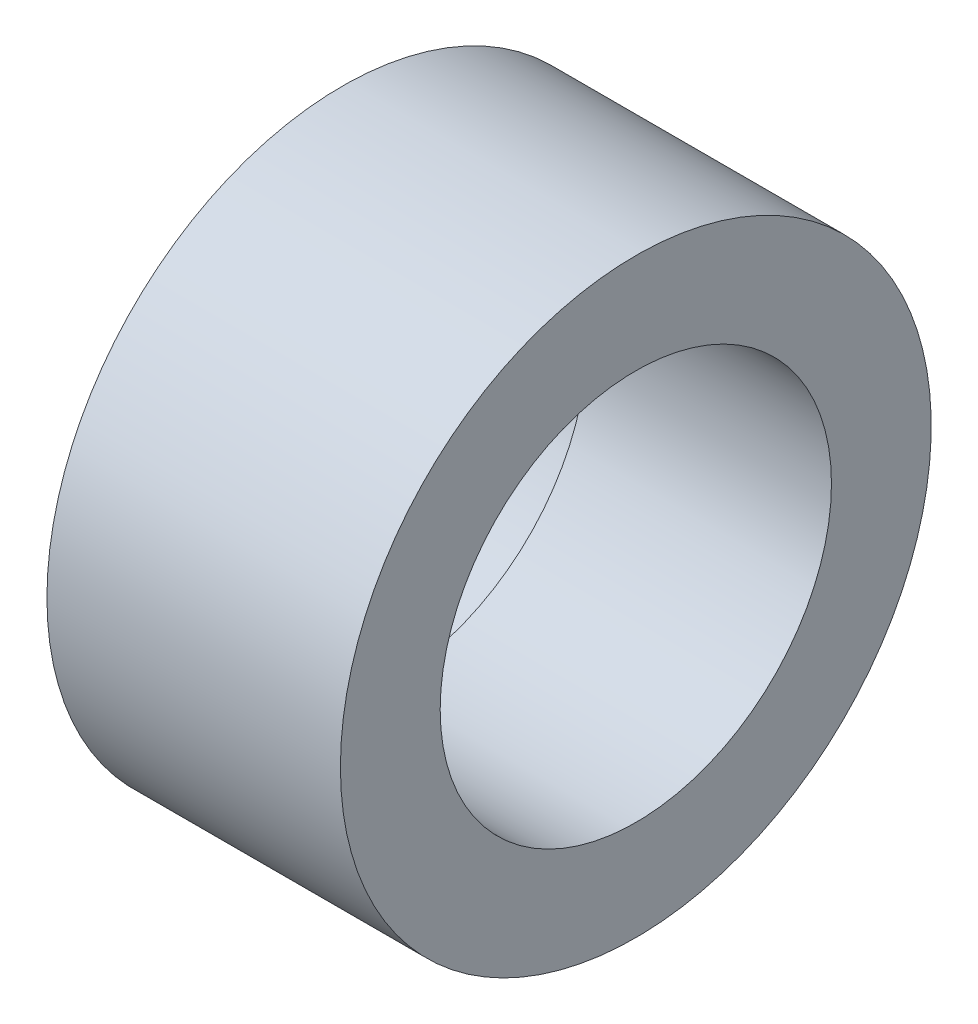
from build123d import *

# Parameters (mm, degrees)
SKETCH1_R           = 19.177
SKETCH1_R_2         = 12.7
BOSS_EXTRUDE1_DEPTH = 19.05
SKETCH2_R           = 12.827
CUT_EXTRUDE1_DEPTH  = 3.175


with BuildPart() as part:
    # Sketch1 → Boss-Extrude1 (new body)
    with BuildSketch(Plane(origin=(0, 0, 0), x_dir=(0, 0, -1), z_dir=(1, 0, 0))):
        with Locations(Location((0, 0, 0), (0, 0, 180))):
            Circle(SKETCH1_R)
        with Locations(Location((0, 0, 0), (0, 0, 180))):
            Circle(SKETCH1_R_2, mode=Mode.SUBTRACT)
    extrude(amount=BOSS_EXTRUDE1_DEPTH)

    # Sketch2 → Cut-Extrude1 (cut)
    with BuildSketch(Plane.ZY):
        Circle(SKETCH2_R)
    extrude(amount=-CUT_EXTRUDE1_DEPTH, mode=Mode.SUBTRACT)


solid = part.part
